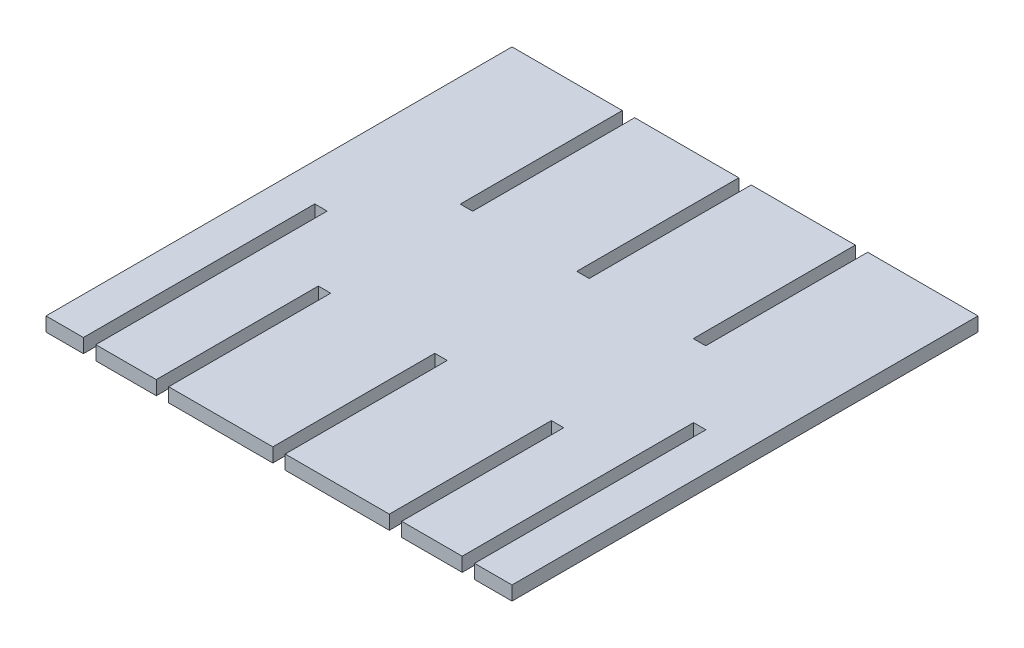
from build123d import *

# Parameters (mm, degrees)
SALIENTE_EXTRUIR1_DEPTH = 3


with BuildPart() as part:
    # Croquis2 → Saliente-Extruir1 (new body)
    with BuildSketch(Plane(origin=(0, 0, 0), x_dir=(1, 0, 0), z_dir=(0, 1, 0))):
        Polygon((0, 0), (8, 0), (8, 49.475), (10.65, 49.475), (10.65, 0), (23.585, 0), (23.585, 34.65), (26.235, 34.65), (26.235, 0), (48.5, 0), (48.5, 34.65), (51.15, 34.65), (51.15, 0), (73.415, 0), (73.415, 34.65), (76.065, 34.65), (76.065, 0), (89, 0), (89, 49.475), (91.65, 49.475), (91.65, 0), (99.65, 0), (99.65, 99.65), (76.065, 99.65), (76.065, 65), (73.415, 65), (73.415, 99.65), (51.15, 99.65), (51.15, 65), (48.5, 65), (48.5, 99.65), (26.235, 99.65), (26.235, 65), (23.585, 65), (23.585, 99.65), (0, 99.65), align=None)
    extrude(amount=SALIENTE_EXTRUIR1_DEPTH)


solid = part.part
